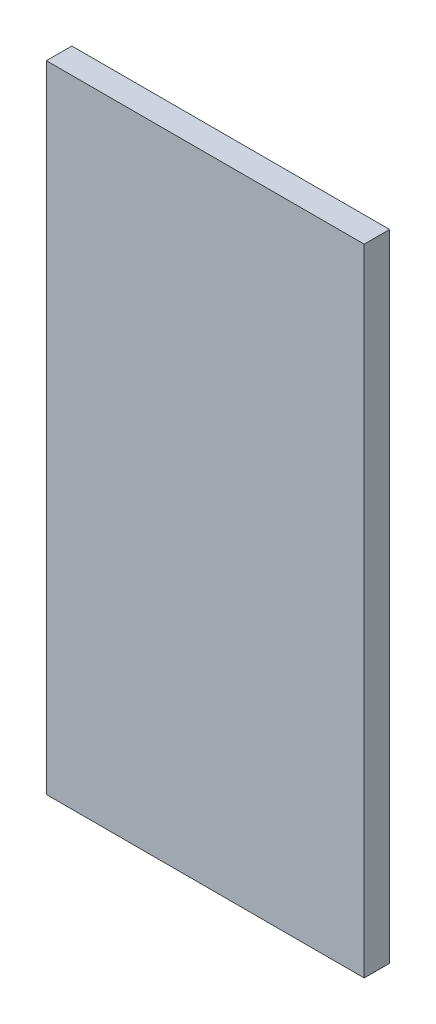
ISO-10303-21;
HEADER;
FILE_DESCRIPTION(('STEP AP214'),'2;1');
FILE_NAME('part.step','',(''),(''),'','','');
FILE_SCHEMA(('AUTOMOTIVE_DESIGN { 1 0 10303 214 1 1 1 1 }'));
ENDSEC;
DATA;
#1=APPLICATION_CONTEXT('core data for automotive mechanical design processes');
#2=APPLICATION_PROTOCOL_DEFINITION('international standard','automotive_design',2000,#1);
#3=PRODUCT_CONTEXT('',#1,'mechanical');
#4=PRODUCT('Part','Part','',(#3));
#5=PRODUCT_RELATED_PRODUCT_CATEGORY('part','',(#4));
#6=PRODUCT_DEFINITION_FORMATION('','',#4);
#7=PRODUCT_DEFINITION_CONTEXT('part definition',#1,'design');
#8=PRODUCT_DEFINITION('design','',#6,#7);
#9=PRODUCT_DEFINITION_SHAPE('','',#8);
#10=(LENGTH_UNIT() NAMED_UNIT(*) SI_UNIT(.MILLI.,.METRE.));
#11=(NAMED_UNIT(*) PLANE_ANGLE_UNIT() SI_UNIT($,.RADIAN.));
#12=(NAMED_UNIT(*) SI_UNIT($,.STERADIAN.) SOLID_ANGLE_UNIT());
#13=UNCERTAINTY_MEASURE_WITH_UNIT(LENGTH_MEASURE(1.E-05),#10,'distance_accuracy_value','');
#14=(GEOMETRIC_REPRESENTATION_CONTEXT(3) GLOBAL_UNCERTAINTY_ASSIGNED_CONTEXT((#13)) GLOBAL_UNIT_ASSIGNED_CONTEXT((#10,
#11,#12)) REPRESENTATION_CONTEXT('',''));
#15=CARTESIAN_POINT('',(0.,0.,0.));
#16=DIRECTION('',(0.,0.,1.));
#17=DIRECTION('',(1.,0.,0.));
#18=AXIS2_PLACEMENT_3D('',#15,#16,#17);
#19=CARTESIAN_POINT('',(0.,0.,12.));
#20=DIRECTION('',(0.,0.,1.));
#21=DIRECTION('',(1.,0.,0.));
#22=AXIS2_PLACEMENT_3D('',#19,#20,#21);
#23=PLANE('',#22);
#24=DIRECTION('',(1.,0.,0.));
#25=VECTOR('',#24,1.);
#26=CARTESIAN_POINT('',(-75.,-150.,12.));
#27=LINE('',#26,#25);
#28=CARTESIAN_POINT('',(-75.,-150.,12.));
#29=VERTEX_POINT('',#28);
#30=CARTESIAN_POINT('',(75.,-150.,12.));
#31=VERTEX_POINT('',#30);
#32=EDGE_CURVE('E67',#29,#31,#27,.T.);
#33=ORIENTED_EDGE('',*,*,#32,.T.);
#34=DIRECTION('',(0.,1.,0.));
#35=VECTOR('',#34,1.);
#36=CARTESIAN_POINT('',(75.,-150.,12.));
#37=LINE('',#36,#35);
#38=CARTESIAN_POINT('',(75.,150.,12.));
#39=VERTEX_POINT('',#38);
#40=EDGE_CURVE('E64',#31,#39,#37,.T.);
#41=ORIENTED_EDGE('',*,*,#40,.T.);
#42=DIRECTION('',(-1.,0.,0.));
#43=VECTOR('',#42,1.);
#44=CARTESIAN_POINT('',(75.,150.,12.));
#45=LINE('',#44,#43);
#46=CARTESIAN_POINT('',(-75.,150.,12.));
#47=VERTEX_POINT('',#46);
#48=EDGE_CURVE('E52',#39,#47,#45,.T.);
#49=ORIENTED_EDGE('',*,*,#48,.T.);
#50=DIRECTION('',(0.,-1.,0.));
#51=VECTOR('',#50,1.);
#52=CARTESIAN_POINT('',(-75.,150.,12.));
#53=LINE('',#52,#51);
#54=EDGE_CURVE('E10',#47,#29,#53,.T.);
#55=ORIENTED_EDGE('',*,*,#54,.T.);
#56=EDGE_LOOP('',(#33,#41,#49,#55));
#57=FACE_BOUND('',#56,.T.);
#58=ADVANCED_FACE('F16',(#57),#23,.T.);
#59=CARTESIAN_POINT('',(0.,0.,0.));
#60=DIRECTION('',(0.,0.,1.));
#61=DIRECTION('',(1.,0.,0.));
#62=AXIS2_PLACEMENT_3D('',#59,#60,#61);
#63=PLANE('',#62);
#64=DIRECTION('',(0.,-1.,0.));
#65=VECTOR('',#64,1.);
#66=CARTESIAN_POINT('',(-75.,150.,0.));
#67=LINE('',#66,#65);
#68=CARTESIAN_POINT('',(-75.,150.,0.));
#69=VERTEX_POINT('',#68);
#70=CARTESIAN_POINT('',(-75.,-150.,0.));
#71=VERTEX_POINT('',#70);
#72=EDGE_CURVE('E25',#69,#71,#67,.T.);
#73=ORIENTED_EDGE('',*,*,#72,.F.);
#74=DIRECTION('',(-1.,0.,0.));
#75=VECTOR('',#74,1.);
#76=CARTESIAN_POINT('',(75.,150.,0.));
#77=LINE('',#76,#75);
#78=CARTESIAN_POINT('',(75.,150.,0.));
#79=VERTEX_POINT('',#78);
#80=EDGE_CURVE('E72',#79,#69,#77,.T.);
#81=ORIENTED_EDGE('',*,*,#80,.F.);
#82=DIRECTION('',(0.,1.,0.));
#83=VECTOR('',#82,1.);
#84=CARTESIAN_POINT('',(75.,-150.,0.));
#85=LINE('',#84,#83);
#86=CARTESIAN_POINT('',(75.,-150.,0.));
#87=VERTEX_POINT('',#86);
#88=EDGE_CURVE('E76',#87,#79,#85,.T.);
#89=ORIENTED_EDGE('',*,*,#88,.F.);
#90=DIRECTION('',(1.,0.,0.));
#91=VECTOR('',#90,1.);
#92=CARTESIAN_POINT('',(-75.,-150.,0.));
#93=LINE('',#92,#91);
#94=EDGE_CURVE('E163',#71,#87,#93,.T.);
#95=ORIENTED_EDGE('',*,*,#94,.F.);
#96=EDGE_LOOP('',(#73,#81,#89,#95));
#97=FACE_BOUND('',#96,.T.);
#98=ADVANCED_FACE('F125',(#97),#63,.F.);
#99=CARTESIAN_POINT('',(-75.,150.,0.));
#100=DIRECTION('',(1.,0.,0.));
#101=DIRECTION('',(0.,1.,0.));
#102=AXIS2_PLACEMENT_3D('',#99,#100,#101);
#103=PLANE('',#102);
#104=ORIENTED_EDGE('',*,*,#72,.T.);
#105=DIRECTION('',(0.,0.,1.));
#106=VECTOR('',#105,1.);
#107=CARTESIAN_POINT('',(-75.,-150.,0.));
#108=LINE('',#107,#106);
#109=EDGE_CURVE('E82',#71,#29,#108,.T.);
#110=ORIENTED_EDGE('',*,*,#109,.T.);
#111=ORIENTED_EDGE('',*,*,#54,.F.);
#112=DIRECTION('',(0.,0.,1.));
#113=VECTOR('',#112,1.);
#114=CARTESIAN_POINT('',(-75.,150.,0.));
#115=LINE('',#114,#113);
#116=EDGE_CURVE('E59',#69,#47,#115,.T.);
#117=ORIENTED_EDGE('',*,*,#116,.F.);
#118=EDGE_LOOP('',(#104,#110,#111,#117));
#119=FACE_BOUND('',#118,.T.);
#120=ADVANCED_FACE('F117',(#119),#103,.F.);
#121=CARTESIAN_POINT('',(75.,150.,0.));
#122=DIRECTION('',(0.,-1.,0.));
#123=DIRECTION('',(0.,0.,-1.));
#124=AXIS2_PLACEMENT_3D('',#121,#122,#123);
#125=PLANE('',#124);
#126=ORIENTED_EDGE('',*,*,#80,.T.);
#127=ORIENTED_EDGE('',*,*,#116,.T.);
#128=ORIENTED_EDGE('',*,*,#48,.F.);
#129=DIRECTION('',(0.,0.,1.));
#130=VECTOR('',#129,1.);
#131=CARTESIAN_POINT('',(75.,150.,0.));
#132=LINE('',#131,#130);
#133=EDGE_CURVE('E57',#79,#39,#132,.T.);
#134=ORIENTED_EDGE('',*,*,#133,.F.);
#135=EDGE_LOOP('',(#126,#127,#128,#134));
#136=FACE_BOUND('',#135,.T.);
#137=ADVANCED_FACE('F55',(#136),#125,.F.);
#138=CARTESIAN_POINT('',(75.,-150.,0.));
#139=DIRECTION('',(-1.,0.,0.));
#140=DIRECTION('',(0.,0.,1.));
#141=AXIS2_PLACEMENT_3D('',#138,#139,#140);
#142=PLANE('',#141);
#143=ORIENTED_EDGE('',*,*,#88,.T.);
#144=ORIENTED_EDGE('',*,*,#133,.T.);
#145=ORIENTED_EDGE('',*,*,#40,.F.);
#146=DIRECTION('',(0.,0.,1.));
#147=VECTOR('',#146,1.);
#148=CARTESIAN_POINT('',(75.,-150.,0.));
#149=LINE('',#148,#147);
#150=EDGE_CURVE('E158',#87,#31,#149,.T.);
#151=ORIENTED_EDGE('',*,*,#150,.F.);
#152=EDGE_LOOP('',(#143,#144,#145,#151));
#153=FACE_BOUND('',#152,.T.);
#154=ADVANCED_FACE('F74',(#153),#142,.F.);
#155=CARTESIAN_POINT('',(-75.,-150.,0.));
#156=DIRECTION('',(0.,1.,0.));
#157=DIRECTION('',(1.,0.,0.));
#158=AXIS2_PLACEMENT_3D('',#155,#156,#157);
#159=PLANE('',#158);
#160=ORIENTED_EDGE('',*,*,#94,.T.);
#161=ORIENTED_EDGE('',*,*,#150,.T.);
#162=ORIENTED_EDGE('',*,*,#32,.F.);
#163=ORIENTED_EDGE('',*,*,#109,.F.);
#164=EDGE_LOOP('',(#160,#161,#162,#163));
#165=FACE_BOUND('',#164,.T.);
#166=ADVANCED_FACE('F96',(#165),#159,.F.);
#167=CLOSED_SHELL('',(#58,#98,#120,#137,#154,#166));
#168=MANIFOLD_SOLID_BREP('B1',#167);
#169=ADVANCED_BREP_SHAPE_REPRESENTATION('',(#18,#168),#14);
#170=SHAPE_DEFINITION_REPRESENTATION(#9,#169);
ENDSEC;
END-ISO-10303-21;
